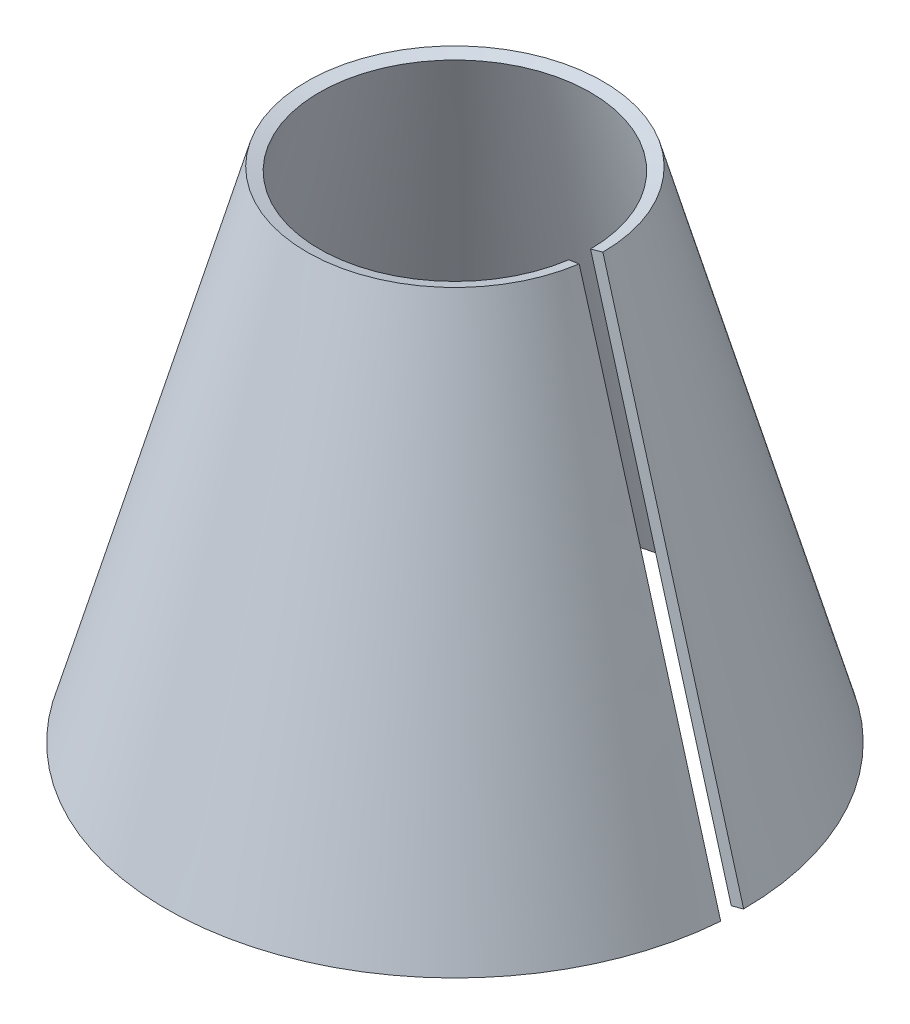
ISO-10303-21;
HEADER;
FILE_DESCRIPTION(('STEP AP214'),'2;1');
FILE_NAME('part.step','',(''),(''),'','','');
FILE_SCHEMA(('AUTOMOTIVE_DESIGN { 1 0 10303 214 1 1 1 1 }'));
ENDSEC;
DATA;
#1=APPLICATION_CONTEXT('core data for automotive mechanical design processes');
#2=APPLICATION_PROTOCOL_DEFINITION('international standard','automotive_design',2000,#1);
#3=PRODUCT_CONTEXT('',#1,'mechanical');
#4=PRODUCT('Part','Part','',(#3));
#5=PRODUCT_RELATED_PRODUCT_CATEGORY('part','',(#4));
#6=PRODUCT_DEFINITION_FORMATION('','',#4);
#7=PRODUCT_DEFINITION_CONTEXT('part definition',#1,'design');
#8=PRODUCT_DEFINITION('design','',#6,#7);
#9=PRODUCT_DEFINITION_SHAPE('','',#8);
#10=(LENGTH_UNIT() NAMED_UNIT(*) SI_UNIT(.MILLI.,.METRE.));
#11=(NAMED_UNIT(*) PLANE_ANGLE_UNIT() SI_UNIT($,.RADIAN.));
#12=(NAMED_UNIT(*) SI_UNIT($,.STERADIAN.) SOLID_ANGLE_UNIT());
#13=UNCERTAINTY_MEASURE_WITH_UNIT(LENGTH_MEASURE(1.E-05),#10,'distance_accuracy_value','');
#14=(GEOMETRIC_REPRESENTATION_CONTEXT(3) GLOBAL_UNCERTAINTY_ASSIGNED_CONTEXT((#13)) GLOBAL_UNIT_ASSIGNED_CONTEXT((#10,
#11,#12)) REPRESENTATION_CONTEXT('',''));
#15=CARTESIAN_POINT('',(0.,0.,0.));
#16=DIRECTION('',(0.,0.,1.));
#17=DIRECTION('',(1.,0.,0.));
#18=AXIS2_PLACEMENT_3D('',#15,#16,#17);
#19=CARTESIAN_POINT('',(0.,98.4631230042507,0.));
#20=DIRECTION('',(0.,1.,0.));
#21=DIRECTION('',(0.,0.,1.));
#22=AXIS2_PLACEMENT_3D('',#19,#20,#21);
#23=CONICAL_SURFACE('',#22,28.10571724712,1.29561044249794);
#24=CARTESIAN_POINT('',(26.582516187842,98.1180311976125,4.01154323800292));
#25=CARTESIAN_POINT('',(28.9995803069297,98.8082148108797,4.37630017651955));
#26=B_SPLINE_CURVE_WITH_KNOTS('',1,(#24,#25),.UNSPECIFIED.,.F.,.F.,(2,2),(0.,1.),.UNSPECIFIED.);
#27=CARTESIAN_POINT('',(26.5825161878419,98.1180311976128,4.01154323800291));
#28=VERTEX_POINT('',#27);
#29=CARTESIAN_POINT('',(28.9995803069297,98.8082148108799,4.37630017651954));
#30=VERTEX_POINT('',#29);
#31=EDGE_CURVE('E13',#28,#30,#26,.T.);
#32=ORIENTED_EDGE('',*,*,#31,.F.);
#33=CARTESIAN_POINT('',(0.,98.1180311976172,0.));
#34=DIRECTION('',(0.,-1.,0.));
#35=DIRECTION('',(0.,0.,-1.));
#36=AXIS2_PLACEMENT_3D('',#33,#34,#35);
#37=CIRCLE('',#36,26.8835013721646);
#38=CARTESIAN_POINT('',(26.8835013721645,98.1180311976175,0.));
#39=VERTEX_POINT('',#38);
#40=EDGE_CURVE('E97',#39,#28,#37,.F.);
#41=ORIENTED_EDGE('',*,*,#40,.F.);
#42=DIRECTION('',(0.962374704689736,0.271725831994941,0.));
#43=VECTOR('',#42,1.);
#44=CARTESIAN_POINT('',(28.1057172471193,98.4631230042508,0.));
#45=LINE('',#44,#43);
#46=CARTESIAN_POINT('',(29.3279331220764,98.8082148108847,0.));
#47=VERTEX_POINT('',#46);
#48=EDGE_CURVE('E56',#39,#47,#45,.T.);
#49=ORIENTED_EDGE('',*,*,#48,.T.);
#50=CARTESIAN_POINT('',(0.,98.8082148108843,0.));
#51=DIRECTION('',(0.,-1.,0.));
#52=DIRECTION('',(0.,0.,-1.));
#53=AXIS2_PLACEMENT_3D('',#50,#51,#52);
#54=CIRCLE('',#53,29.3279331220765);
#55=EDGE_CURVE('E96',#47,#30,#54,.F.);
#56=ORIENTED_EDGE('',*,*,#55,.T.);
#57=EDGE_LOOP('',(#32,#41,#49,#56));
#58=FACE_BOUND('',#57,.T.);
#59=ADVANCED_FACE('F42',(#58),#23,.F.);
#60=CARTESIAN_POINT('',(56.0041483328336,-0.345091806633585,0.));
#61=DIRECTION('',(0.,0.,-1.));
#62=DIRECTION('',(-0.27172583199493,0.962374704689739,0.));
#63=AXIS2_PLACEMENT_3D('',#60,#61,#62);
#64=PLANE('',#63);
#65=ORIENTED_EDGE('',*,*,#48,.F.);
#66=DIRECTION('',(0.271725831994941,-0.962374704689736,0.));
#67=VECTOR('',#66,1.);
#68=CARTESIAN_POINT('',(335.839104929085,-996.113811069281,0.));
#69=LINE('',#68,#67);
#70=CARTESIAN_POINT('',(54.7819324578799,-0.69018361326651,0.));
#71=VERTEX_POINT('',#70);
#72=EDGE_CURVE('E114',#71,#39,#69,.F.);
#73=ORIENTED_EDGE('',*,*,#72,.F.);
#74=DIRECTION('',(0.962374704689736,0.271725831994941,0.));
#75=VECTOR('',#74,1.);
#76=CARTESIAN_POINT('',(56.0041483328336,-0.345091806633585,0.));
#77=LINE('',#76,#75);
#78=CARTESIAN_POINT('',(57.2263642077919,6.52364447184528E-13,0.));
#79=VERTEX_POINT('',#78);
#80=EDGE_CURVE('E92',#71,#79,#77,.T.);
#81=ORIENTED_EDGE('',*,*,#80,.T.);
#82=DIRECTION('',(0.271725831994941,-0.962374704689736,0.));
#83=VECTOR('',#82,1.);
#84=CARTESIAN_POINT('',(338.283536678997,-995.423627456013,0.));
#85=LINE('',#84,#83);
#86=EDGE_CURVE('E104',#79,#47,#85,.F.);
#87=ORIENTED_EDGE('',*,*,#86,.T.);
#88=EDGE_LOOP('',(#65,#73,#81,#87));
#89=FACE_BOUND('',#88,.T.);
#90=ADVANCED_FACE('F108',(#89),#64,.F.);
#91=CARTESIAN_POINT('',(0.,-0.345091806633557,0.));
#92=DIRECTION('',(0.,1.,0.));
#93=DIRECTION('',(0.,0.,1.));
#94=AXIS2_PLACEMENT_3D('',#91,#92,#93);
#95=CONICAL_SURFACE('',#94,56.0041483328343,1.29561044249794);
#96=ORIENTED_EDGE('',*,*,#80,.F.);
#97=CARTESIAN_POINT('',(0.,-0.690183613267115,0.));
#98=DIRECTION('',(0.,-1.,0.));
#99=DIRECTION('',(0.,0.,-1.));
#100=AXIS2_PLACEMENT_3D('',#97,#98,#99);
#101=CIRCLE('',#100,54.7819324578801);
#102=CARTESIAN_POINT('',(54.621509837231,-0.690183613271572,4.18936593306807));
#103=VERTEX_POINT('',#102);
#104=EDGE_CURVE('E109',#71,#103,#101,.F.);
#105=ORIENTED_EDGE('',*,*,#104,.T.);
#106=CARTESIAN_POINT('',(57.0587833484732,-4.42256908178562E-12,4.37630017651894));
#107=CARTESIAN_POINT('',(54.621509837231,-0.690183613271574,4.18936593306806));
#108=B_SPLINE_CURVE_WITH_KNOTS('',1,(#106,#107),.UNSPECIFIED.,.F.,.F.,(2,2),(0.,1.),.UNSPECIFIED.);
#109=CARTESIAN_POINT('',(57.0587833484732,-4.44089209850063E-12,4.37630017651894));
#110=VERTEX_POINT('',#109);
#111=EDGE_CURVE('E64',#103,#110,#108,.F.);
#112=ORIENTED_EDGE('',*,*,#111,.T.);
#113=CARTESIAN_POINT('',(0.,0.,0.));
#114=DIRECTION('',(0.,-1.,0.));
#115=DIRECTION('',(0.,0.,-1.));
#116=AXIS2_PLACEMENT_3D('',#113,#114,#115);
#117=CIRCLE('',#116,57.226364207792);
#118=EDGE_CURVE('E233',#79,#110,#117,.F.);
#119=ORIENTED_EDGE('',*,*,#118,.F.);
#120=EDGE_LOOP('',(#96,#105,#112,#119));
#121=FACE_BOUND('',#120,.T.);
#122=ADVANCED_FACE('F136',(#121),#95,.T.);
#123=CARTESIAN_POINT('',(28.9995803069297,98.8082148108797,4.37630017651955));
#124=CARTESIAN_POINT('',(29.7280403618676,96.2633312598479,4.36451771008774));
#125=CARTESIAN_POINT('',(30.4625193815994,93.6937188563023,4.35465808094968));
#126=CARTESIAN_POINT('',(31.573151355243,89.8022062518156,4.34571432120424));
#127=CARTESIAN_POINT('',(31.9448479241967,88.4988530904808,4.34370864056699));
#128=CARTESIAN_POINT('',(32.5046092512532,86.5345499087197,4.34254518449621));
#129=CARTESIAN_POINT('',(32.6912564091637,85.8793262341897,4.34246057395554));
#130=CARTESIAN_POINT('',(33.0771418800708,84.5239732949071,4.34337211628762));
#131=CARTESIAN_POINT('',(33.2749127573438,83.8290232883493,4.34430723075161));
#132=CARTESIAN_POINT('',(33.6801161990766,82.4045762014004,4.3471007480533));
#133=CARTESIAN_POINT('',(33.8875487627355,81.6750791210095,4.34895915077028));
#134=CARTESIAN_POINT('',(34.1528811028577,80.7416158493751,4.35183886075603));
#135=CARTESIAN_POINT('',(34.2062496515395,80.5538435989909,4.35244264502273));
#136=CARTESIAN_POINT('',(34.2867556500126,80.2705658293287,4.35338972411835));
#137=CARTESIAN_POINT('',(34.3138207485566,80.1753277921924,4.35371314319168));
#138=CARTESIAN_POINT('',(34.3712877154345,79.9731147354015,4.35438190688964));
#139=CARTESIAN_POINT('',(34.4013007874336,79.8675063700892,4.35472581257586));
#140=CARTESIAN_POINT('',(34.557764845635,79.3169553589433,4.35648174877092));
#141=CARTESIAN_POINT('',(34.7034117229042,78.804485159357,4.35800679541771));
#142=CARTESIAN_POINT('',(35.0356794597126,77.6354859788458,4.36094979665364));
#143=CARTESIAN_POINT('',(35.2223003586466,76.9789569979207,4.36236775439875));
#144=CARTESIAN_POINT('',(35.5329827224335,75.886119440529,4.36408074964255));
#145=CARTESIAN_POINT('',(35.6416687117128,75.5038329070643,4.36458199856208));
#146=CARTESIAN_POINT('',(35.8123883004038,74.9033920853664,4.36518070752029));
#147=CARTESIAN_POINT('',(35.8705765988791,74.6987433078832,4.36535470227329));
#148=CARTESIAN_POINT('',(35.9895172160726,74.2804420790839,4.36564288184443));
#149=CARTESIAN_POINT('',(36.0506809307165,74.0653422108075,4.36575907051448));
#150=CARTESIAN_POINT('',(36.5995245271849,72.1352642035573,4.36642727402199));
#151=CARTESIAN_POINT('',(37.0865242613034,70.4232733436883,4.36444179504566));
#152=CARTESIAN_POINT('',(37.6941743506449,68.2878273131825,4.35873102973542));
#153=CARTESIAN_POINT('',(37.8144618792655,67.8651916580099,4.3573085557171));
#154=CARTESIAN_POINT('',(38.0630849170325,66.9913370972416,4.35495952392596));
#155=CARTESIAN_POINT('',(38.1910213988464,66.5415393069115,4.35399040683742));
#156=CARTESIAN_POINT('',(38.5857093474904,65.1535344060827,4.35165436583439));
#157=CARTESIAN_POINT('',(38.8633393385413,64.1767157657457,4.35085896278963));
#158=CARTESIAN_POINT('',(39.3015554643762,62.6342647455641,4.35062545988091));
#159=CARTESIAN_POINT('',(39.4508500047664,62.1086814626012,4.35068642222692));
#160=CARTESIAN_POINT('',(39.7585019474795,61.0253881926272,4.35119060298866));
#161=CARTESIAN_POINT('',(39.918011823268,60.4635978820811,4.35169305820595));
#162=CARTESIAN_POINT('',(40.413599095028,58.7177959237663,4.35386773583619));
#163=CARTESIAN_POINT('',(40.7667341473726,57.4733532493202,4.35620820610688));
#164=CARTESIAN_POINT('',(41.189615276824,55.9827087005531,4.35957927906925));
#165=CARTESIAN_POINT('',(41.2369576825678,55.8158225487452,4.35996407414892));
#166=CARTESIAN_POINT('',(41.3323537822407,55.479532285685,4.36075317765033));
#167=CARTESIAN_POINT('',(41.3822871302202,55.3035054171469,4.3611641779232));
#168=CARTESIAN_POINT('',(41.5452383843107,54.7290751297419,4.36244444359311));
#169=CARTESIAN_POINT('',(41.6687409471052,54.2937170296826,4.36335330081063));
#170=CARTESIAN_POINT('',(42.0838661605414,52.8304290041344,4.36601825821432));
#171=CARTESIAN_POINT('',(42.4201057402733,51.6452853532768,4.36773093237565));
#172=CARTESIAN_POINT('',(42.8653476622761,50.0761781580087,4.36865733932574));
#173=CARTESIAN_POINT('',(42.9157491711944,49.898557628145,4.36874600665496));
#174=CARTESIAN_POINT('',(43.0184127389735,49.5367659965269,4.36889094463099));
#175=CARTESIAN_POINT('',(43.0709545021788,49.3516090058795,4.36894799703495));
#176=CARTESIAN_POINT('',(43.2280656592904,48.7979624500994,4.36905455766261));
#177=CARTESIAN_POINT('',(43.332789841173,48.4289392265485,4.36904295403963));
#178=CARTESIAN_POINT('',(43.6469123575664,47.3220929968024,4.3687600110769));
#179=CARTESIAN_POINT('',(43.8562606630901,46.5844934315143,4.36824053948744));
#180=CARTESIAN_POINT('',(44.2748224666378,45.1098901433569,4.36653884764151));
#181=CARTESIAN_POINT('',(44.4840359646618,44.3728864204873,4.36535662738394));
#182=CARTESIAN_POINT('',(44.7977540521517,43.2678277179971,4.36308544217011));
#183=CARTESIAN_POINT('',(44.9021835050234,42.899997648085,4.36223549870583));
#184=CARTESIAN_POINT('',(45.1168956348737,42.1435632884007,4.36086312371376));
#185=CARTESIAN_POINT('',(45.2264469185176,41.7575586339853,4.36027816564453));
#186=CARTESIAN_POINT('',(45.5616875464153,40.5761822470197,4.35881035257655));
#187=CARTESIAN_POINT('',(45.7939636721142,39.7574480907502,4.35821461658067));
#188=CARTESIAN_POINT('',(46.1555558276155,38.4826220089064,4.35782767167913));
#189=CARTESIAN_POINT('',(46.2782828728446,38.0498925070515,4.35778311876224));
#190=CARTESIAN_POINT('',(46.5281303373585,37.1688585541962,4.35785143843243));
#191=CARTESIAN_POINT('',(46.6551074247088,36.7210615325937,4.35795843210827));
#192=CARTESIAN_POINT('',(47.0466368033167,35.3401204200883,4.35867150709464));
#193=CARTESIAN_POINT('',(47.320510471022,34.3739475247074,4.35961164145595));
#194=CARTESIAN_POINT('',(47.7506089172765,32.8563699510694,4.36160389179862));
#195=CARTESIAN_POINT('',(47.8971897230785,32.3391243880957,4.36236493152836));
#196=CARTESIAN_POINT('',(48.1218837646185,31.5461764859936,4.3636370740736));
#197=CARTESIAN_POINT('',(48.1975855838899,31.2790139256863,4.36408288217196));
#198=CARTESIAN_POINT('',(48.3123441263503,30.8740001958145,4.36478234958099));
#199=CARTESIAN_POINT('',(48.3508727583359,30.7380200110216,4.36502096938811));
#200=CARTESIAN_POINT('',(48.4327424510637,30.4490790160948,4.36550710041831));
#201=CARTESIAN_POINT('',(48.4755340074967,30.2980565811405,4.3657542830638));
#202=CARTESIAN_POINT('',(48.8773694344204,28.8798872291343,4.36799396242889));
#203=CARTESIAN_POINT('',(49.353390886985,27.1999682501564,4.37016270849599));
#204=CARTESIAN_POINT('',(50.022688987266,24.8383198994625,4.37084587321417));
#205=CARTESIAN_POINT('',(50.0993693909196,24.5677536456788,4.37089679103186));
#206=CARTESIAN_POINT('',(50.2517742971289,24.0300051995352,4.37093127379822));
#207=CARTESIAN_POINT('',(50.3279733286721,23.7611483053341,4.37091648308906));
#208=CARTESIAN_POINT('',(50.5565601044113,22.9546296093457,4.37077595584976));
#209=CARTESIAN_POINT('',(50.7089375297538,22.4170197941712,4.37055406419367));
#210=CARTESIAN_POINT('',(51.1660280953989,20.8043982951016,4.36950329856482));
#211=CARTESIAN_POINT('',(51.4706995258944,19.7295945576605,4.36828933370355));
#212=CARTESIAN_POINT('',(51.8514678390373,18.3864364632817,4.36612849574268));
#213=CARTESIAN_POINT('',(51.9288812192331,18.1133508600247,4.36570806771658));
#214=CARTESIAN_POINT('',(52.0906337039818,17.5426777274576,4.36503193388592));
#215=CARTESIAN_POINT('',(52.1743059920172,17.2474503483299,4.36475325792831));
#216=CARTESIAN_POINT('',(52.4337117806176,16.3320957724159,4.36407883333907));
#217=CARTESIAN_POINT('',(52.617834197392,15.6822961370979,4.36384496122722));
#218=CARTESIAN_POINT('',(53.0084538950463,14.3035703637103,4.36371377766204));
#219=CARTESIAN_POINT('',(53.2149511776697,13.574644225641,4.36381646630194));
#220=CARTESIAN_POINT('',(53.5414817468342,12.4219101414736,4.36414516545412));
#221=CARTESIAN_POINT('',(53.6532983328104,12.0271550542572,4.36428211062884));
#222=CARTESIAN_POINT('',(53.8779542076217,11.2339978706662,4.3646288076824));
#223=CARTESIAN_POINT('',(53.9913530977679,10.8336211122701,4.36483624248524));
#224=CARTESIAN_POINT('',(55.0215824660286,7.19604678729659,4.36699609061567));
#225=CARTESIAN_POINT('',(56.0058889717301,3.71956477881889,4.37099839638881));
#226=CARTESIAN_POINT('',(57.0587833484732,-4.42256908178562E-12,4.37630017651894));
#227=CARTESIAN_POINT('',(26.582516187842,98.1180311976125,4.01154323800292));
#228=CARTESIAN_POINT('',(27.3094794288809,95.5731475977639,4.00967951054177));
#229=CARTESIAN_POINT('',(28.0426448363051,93.0035352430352,4.00893546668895));
#230=CARTESIAN_POINT('',(29.1515400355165,89.1120226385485,4.01245348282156));
#231=CARTESIAN_POINT('',(29.5226966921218,87.8086694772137,4.01439981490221));
#232=CARTESIAN_POINT('',(30.081702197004,85.8443662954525,4.01886082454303));
#233=CARTESIAN_POINT('',(30.2681066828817,85.1891426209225,4.02059829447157));
#234=CARTESIAN_POINT('',(30.6535133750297,83.8337896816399,4.02513510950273));
#235=CARTESIAN_POINT('',(30.8510495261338,83.1388396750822,4.02786321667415));
#236=CARTESIAN_POINT('',(31.2557925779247,81.7143925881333,4.03420338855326));
#237=CARTESIAN_POINT('',(31.4629994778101,80.9848955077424,4.03781545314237));
#238=CARTESIAN_POINT('',(31.7280552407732,80.0514322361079,4.04286263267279));
#239=CARTESIAN_POINT('',(31.7813687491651,79.8636599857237,4.04389868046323));
#240=CARTESIAN_POINT('',(31.8617925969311,79.5803822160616,4.04549230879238));
#241=CARTESIAN_POINT('',(31.8888302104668,79.4851441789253,4.0460322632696));
#242=CARTESIAN_POINT('',(31.9462388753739,79.2829311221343,4.04716088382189));
#243=CARTESIAN_POINT('',(31.9762215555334,79.1773227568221,4.04774476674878));
#244=CARTESIAN_POINT('',(32.1325274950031,78.6267717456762,4.050750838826));
#245=CARTESIAN_POINT('',(32.278028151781,78.1143015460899,4.0534367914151));
#246=CARTESIAN_POINT('',(32.6099653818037,76.9453023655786,4.05902337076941));
#247=CARTESIAN_POINT('',(32.7964019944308,76.2887733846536,4.06192400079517));
#248=CARTESIAN_POINT('',(33.1067807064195,75.1959358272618,4.0661024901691));
#249=CARTESIAN_POINT('',(33.2153609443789,74.8136492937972,4.06746581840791));
#250=CARTESIAN_POINT('',(33.3859152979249,74.2132084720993,4.0694180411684));
#251=CARTESIAN_POINT('',(33.4440474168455,74.0085596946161,4.07005327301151));
#252=CARTESIAN_POINT('',(33.5628735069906,73.5902584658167,4.07128406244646));
#253=CARTESIAN_POINT('',(33.6239784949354,73.3751585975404,4.07188476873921));
#254=CARTESIAN_POINT('',(34.1722961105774,71.4450805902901,4.07690358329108));
#255=CARTESIAN_POINT('',(34.6588364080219,69.7330897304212,4.0787958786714));
#256=CARTESIAN_POINT('',(35.2659225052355,67.5976436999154,4.07794550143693));
#257=CARTESIAN_POINT('',(35.386097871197,67.1750080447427,4.07749470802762));
#258=CARTESIAN_POINT('',(35.6344967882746,66.3011534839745,4.07709760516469));
#259=CARTESIAN_POINT('',(35.7623213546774,65.8513556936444,4.07710838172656));
#260=CARTESIAN_POINT('',(36.1566740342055,64.4633507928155,4.07772381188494));
#261=CARTESIAN_POINT('',(36.4340811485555,63.4865321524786,4.07891177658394));
#262=CARTESIAN_POINT('',(36.8719640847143,61.944081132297,4.0816769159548));
#263=CARTESIAN_POINT('',(37.0211479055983,61.418497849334,4.08273993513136));
#264=CARTESIAN_POINT('',(37.3285781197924,60.33520457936,4.08526241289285));
#265=CARTESIAN_POINT('',(37.4879765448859,59.773414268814,4.08678514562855));
#266=CARTESIAN_POINT('',(37.9832278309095,58.0276123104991,4.09205405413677));
#267=CARTESIAN_POINT('',(38.3361367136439,56.7831696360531,4.0965018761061));
#268=CARTESIAN_POINT('',(38.7587613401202,55.292525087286,4.10229385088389));
#269=CARTESIAN_POINT('',(38.8060752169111,55.1256389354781,4.10294833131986));
#270=CARTESIAN_POINT('',(38.9014142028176,54.7893486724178,4.10427819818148));
#271=CARTESIAN_POINT('',(38.9513177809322,54.6133218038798,4.10497148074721));
#272=CARTESIAN_POINT('',(39.1141720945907,54.0388915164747,4.10717271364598));
#273=CARTESIAN_POINT('',(39.2376015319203,53.6035334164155,4.10877848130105));
#274=CARTESIAN_POINT('',(39.6524825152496,52.1402453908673,4.11378303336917));
#275=CARTESIAN_POINT('',(39.9885260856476,50.9551017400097,4.11738725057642));
#276=CARTESIAN_POINT('',(40.4335127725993,49.3859945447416,4.12081519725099));
#277=CARTESIAN_POINT('',(40.4838854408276,49.2083740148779,4.1211870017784));
#278=CARTESIAN_POINT('',(40.5864903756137,48.8465823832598,4.12190859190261));
#279=CARTESIAN_POINT('',(40.6390021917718,48.6614253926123,4.12226069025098));
#280=CARTESIAN_POINT('',(40.7960239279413,48.1077788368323,4.12324986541));
#281=CARTESIAN_POINT('',(40.9006886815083,47.7387556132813,4.12382696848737));
#282=CARTESIAN_POINT('',(41.2146334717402,46.6319093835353,4.12531103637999));
#283=CARTESIAN_POINT('',(41.4238640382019,45.8943098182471,4.12597075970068));
#284=CARTESIAN_POINT('',(41.84219186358,44.4197065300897,4.12662983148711));
#285=CARTESIAN_POINT('',(42.0512891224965,43.6827028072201,4.12662917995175));
#286=CARTESIAN_POINT('',(42.3648339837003,42.5776441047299,4.12613212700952));
#287=CARTESIAN_POINT('',(42.4692058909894,42.2098140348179,4.1258737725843));
#288=CARTESIAN_POINT('',(42.6838029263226,41.4533796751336,4.12568912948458));
#289=CARTESIAN_POINT('',(42.7932967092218,41.0673750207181,4.12569982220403));
#290=CARTESIAN_POINT('',(43.1283649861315,39.8859986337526,4.12602431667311));
#291=CARTESIAN_POINT('',(43.36052641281,39.0672644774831,4.12663059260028));
#292=CARTESIAN_POINT('',(43.7219468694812,37.7924383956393,4.12805737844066));
#293=CARTESIAN_POINT('',(43.8446167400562,37.3597088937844,4.12861918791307));
#294=CARTESIAN_POINT('',(44.0943499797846,36.478674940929,4.12990380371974));
#295=CARTESIAN_POINT('',(44.2212700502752,36.0308779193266,4.13062036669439));
#296=CARTESIAN_POINT('',(44.6126276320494,34.6499368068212,4.13317769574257));
#297=CARTESIAN_POINT('',(44.8863860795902,33.6837639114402,4.1353648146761));
#298=CARTESIAN_POINT('',(45.3163107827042,32.1661863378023,4.13925377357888));
#299=CARTESIAN_POINT('',(45.4628335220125,31.6489407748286,4.14065142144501));
#300=CARTESIAN_POINT('',(45.6874402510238,30.8559928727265,4.14288503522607));
#301=CARTESIAN_POINT('',(45.7631129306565,30.5888303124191,4.14365242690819));
#302=CARTESIAN_POINT('',(45.8778277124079,30.1838165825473,4.14483590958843));
#303=CARTESIAN_POINT('',(45.9163417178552,30.0478363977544,4.14523647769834));
#304=CARTESIAN_POINT('',(45.9981803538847,29.7588954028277,4.14606689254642));
#305=CARTESIAN_POINT('',(46.0409557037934,29.6078729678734,4.14649393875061));
#306=CARTESIAN_POINT('',(46.4426392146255,28.1897036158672,4.15042188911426));
#307=CARTESIAN_POINT('',(46.9184824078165,26.5097846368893,4.15458552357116));
#308=CARTESIAN_POINT('',(47.5875354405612,24.1481362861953,4.15806927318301));
#309=CARTESIAN_POINT('',(47.664187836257,23.8775700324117,4.15844096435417));
#310=CARTESIAN_POINT('',(47.8165371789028,23.339821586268,4.15911328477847));
#311=CARTESIAN_POINT('',(47.8927084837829,23.070964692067,4.15941750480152));
#312=CARTESIAN_POINT('',(48.1212122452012,22.2644459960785,4.16023428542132));
#313=CARTESIAN_POINT('',(48.2735345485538,21.726836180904,4.1606509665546));
#314=CARTESIAN_POINT('',(48.7304604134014,20.1142146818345,4.16151702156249));
#315=CARTESIAN_POINT('',(49.0350229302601,19.0394109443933,4.16158240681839));
#316=CARTESIAN_POINT('',(49.4156562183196,17.6962528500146,4.16102259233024));
#317=CARTESIAN_POINT('',(49.4930424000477,17.4231672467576,4.16092540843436));
#318=CARTESIAN_POINT('',(49.6547392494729,16.8524941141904,4.1609121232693));
#319=CARTESIAN_POINT('',(49.7383832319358,16.5572667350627,4.16097149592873));
#320=CARTESIAN_POINT('',(49.9977026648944,15.6419121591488,4.16133109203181));
#321=CARTESIAN_POINT('',(50.1817655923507,14.9921125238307,4.16181306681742));
#322=CARTESIAN_POINT('',(50.572262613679,13.6133867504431,4.16316658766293));
#323=CARTESIAN_POINT('',(50.7786967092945,12.8844606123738,4.16403813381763));
#324=CARTESIAN_POINT('',(51.1051298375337,11.7317265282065,4.16555988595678));
#325=CARTESIAN_POINT('',(51.2169134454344,11.3369714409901,4.16610182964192));
#326=CARTESIAN_POINT('',(51.4415039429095,10.543814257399,4.1672539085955));
#327=CARTESIAN_POINT('',(51.5548702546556,10.143437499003,4.16786391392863));
#328=CARTESIAN_POINT('',(52.5848074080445,6.50586317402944,4.17364581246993));
#329=CARTESIAN_POINT('',(53.5688612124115,3.02938116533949,4.18086000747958));
#330=CARTESIAN_POINT('',(54.621509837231,-0.690183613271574,4.18936593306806));
#331=B_SPLINE_SURFACE_WITH_KNOTS('',1,3,((#123,#124,#125,#126,#127,#128,#129,#130,#131,#132,
#133,#134,#135,#136,#137,#138,#139,#140,#141,#142,#143,#144,#145,#146,#147,#148,#149,#150,#151,
#152,#153,#154,#155,#156,#157,#158,#159,#160,#161,#162,#163,#164,#165,#166,#167,#168,#169,#170,
#171,#172,#173,#174,#175,#176,#177,#178,#179,#180,#181,#182,#183,#184,#185,#186,#187,#188,#189,
#190,#191,#192,#193,#194,#195,#196,#197,#198,#199,#200,#201,#202,#203,#204,#205,#206,#207,#208,
#209,#210,#211,#212,#213,#214,#215,#216,#217,#218,#219,#220,#221,#222,#223,#224,#225,#226),
(#227,#228,#229,#230,#231,#232,#233,#234,#235,#236,#237,#238,#239,#240,#241,#242,#243,#244,#245,
#246,#247,#248,#249,#250,#251,#252,#253,#254,#255,#256,#257,#258,#259,#260,#261,#262,#263,#264,
#265,#266,#267,#268,#269,#270,#271,#272,#273,#274,#275,#276,#277,#278,#279,#280,#281,#282,#283,
#284,#285,#286,#287,#288,#289,#290,#291,#292,#293,#294,#295,#296,#297,#298,#299,#300,#301,#302,
#303,#304,#305,#306,#307,#308,#309,#310,#311,#312,#313,#314,#315,#316,#317,#318,#319,#320,#321,
#322,#323,#324,#325,#326,#327,#328,#329,#330)),.UNSPECIFIED.,.F.,.F.,.F.,(2,2),(4,2,2,2,2,2,2,2,
2,2,2,2,2,2,2,2,2,2,2,2,2,2,2,2,2,2,2,2,2,2,2,2,2,2,2,2,2,2,2,2,2,2,2,2,2,2,2,2,2,2,2,4),(0.,
1.),(0.,0.25,0.375,0.4375,0.5,0.5625,0.578125,0.5859375,0.59375,0.625,0.65625,0.671875,
0.6796875,0.6875,0.75,0.765625,0.78125,0.8125,0.828125,0.84375,0.875,0.87890625,0.8828125,
0.890625,0.90625,0.908203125,0.91015625,0.9140625,0.921875,0.9296875,0.93359375,0.9375,
0.9453125,0.94921875,0.953125,0.9609375,0.96484375,0.966796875,0.9677734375,0.96875,0.9765625,
0.9775390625,0.978515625,0.98046875,0.984375,0.9853515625,0.986328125,0.98828125,0.990234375,
0.9912109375,0.9921875,1.),.UNSPECIFIED.);
#332=CARTESIAN_POINT('',(54.621509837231,-0.690183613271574,4.18936593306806));
#333=CARTESIAN_POINT('',(53.5688612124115,3.02938116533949,4.18086000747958));
#334=CARTESIAN_POINT('',(52.5848074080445,6.50586317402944,4.17364581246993));
#335=CARTESIAN_POINT('',(51.5548702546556,10.143437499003,4.16786391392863));
#336=CARTESIAN_POINT('',(51.4415039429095,10.543814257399,4.1672539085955));
#337=CARTESIAN_POINT('',(51.2169134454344,11.3369714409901,4.16610182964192));
#338=CARTESIAN_POINT('',(51.1051298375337,11.7317265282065,4.16555988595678));
#339=CARTESIAN_POINT('',(50.7786967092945,12.8844606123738,4.16403813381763));
#340=CARTESIAN_POINT('',(50.572262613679,13.6133867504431,4.16316658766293));
#341=CARTESIAN_POINT('',(50.1817655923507,14.9921125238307,4.16181306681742));
#342=CARTESIAN_POINT('',(49.9977026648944,15.6419121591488,4.16133109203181));
#343=CARTESIAN_POINT('',(49.7383832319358,16.5572667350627,4.16097149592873));
#344=CARTESIAN_POINT('',(49.6547392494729,16.8524941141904,4.1609121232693));
#345=CARTESIAN_POINT('',(49.4930424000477,17.4231672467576,4.16092540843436));
#346=CARTESIAN_POINT('',(49.4156562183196,17.6962528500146,4.16102259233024));
#347=CARTESIAN_POINT('',(49.0350229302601,19.0394109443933,4.16158240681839));
#348=CARTESIAN_POINT('',(48.7304604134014,20.1142146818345,4.16151702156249));
#349=CARTESIAN_POINT('',(48.2735345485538,21.726836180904,4.1606509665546));
#350=CARTESIAN_POINT('',(48.1212122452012,22.2644459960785,4.16023428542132));
#351=CARTESIAN_POINT('',(47.8927084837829,23.070964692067,4.15941750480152));
#352=CARTESIAN_POINT('',(47.8165371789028,23.339821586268,4.15911328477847));
#353=CARTESIAN_POINT('',(47.664187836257,23.8775700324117,4.15844096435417));
#354=CARTESIAN_POINT('',(47.5875354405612,24.1481362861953,4.15806927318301));
#355=CARTESIAN_POINT('',(46.9184824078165,26.5097846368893,4.15458552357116));
#356=CARTESIAN_POINT('',(46.4426392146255,28.1897036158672,4.15042188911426));
#357=CARTESIAN_POINT('',(46.0409557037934,29.6078729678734,4.14649393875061));
#358=CARTESIAN_POINT('',(45.9981803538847,29.7588954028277,4.14606689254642));
#359=CARTESIAN_POINT('',(45.9163417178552,30.0478363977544,4.14523647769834));
#360=CARTESIAN_POINT('',(45.8778277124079,30.1838165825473,4.14483590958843));
#361=CARTESIAN_POINT('',(45.7631129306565,30.5888303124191,4.14365242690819));
#362=CARTESIAN_POINT('',(45.6874402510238,30.8559928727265,4.14288503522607));
#363=CARTESIAN_POINT('',(45.4628335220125,31.6489407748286,4.14065142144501));
#364=CARTESIAN_POINT('',(45.3163107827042,32.1661863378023,4.13925377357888));
#365=CARTESIAN_POINT('',(44.8863860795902,33.6837639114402,4.1353648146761));
#366=CARTESIAN_POINT('',(44.6126276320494,34.6499368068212,4.13317769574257));
#367=CARTESIAN_POINT('',(44.2212700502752,36.0308779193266,4.13062036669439));
#368=CARTESIAN_POINT('',(44.0943499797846,36.478674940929,4.12990380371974));
#369=CARTESIAN_POINT('',(43.8446167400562,37.3597088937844,4.12861918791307));
#370=CARTESIAN_POINT('',(43.7219468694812,37.7924383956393,4.12805737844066));
#371=CARTESIAN_POINT('',(43.36052641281,39.0672644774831,4.12663059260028));
#372=CARTESIAN_POINT('',(43.1283649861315,39.8859986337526,4.12602431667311));
#373=CARTESIAN_POINT('',(42.7932967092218,41.0673750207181,4.12569982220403));
#374=CARTESIAN_POINT('',(42.6838029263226,41.4533796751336,4.12568912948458));
#375=CARTESIAN_POINT('',(42.4692058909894,42.2098140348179,4.1258737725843));
#376=CARTESIAN_POINT('',(42.3648339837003,42.5776441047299,4.12613212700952));
#377=CARTESIAN_POINT('',(42.0512891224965,43.6827028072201,4.12662917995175));
#378=CARTESIAN_POINT('',(41.84219186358,44.4197065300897,4.12662983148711));
#379=CARTESIAN_POINT('',(41.4238640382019,45.8943098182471,4.12597075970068));
#380=CARTESIAN_POINT('',(41.2146334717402,46.6319093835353,4.12531103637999));
#381=CARTESIAN_POINT('',(40.9006886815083,47.7387556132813,4.12382696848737));
#382=CARTESIAN_POINT('',(40.7960239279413,48.1077788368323,4.12324986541));
#383=CARTESIAN_POINT('',(40.6390021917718,48.6614253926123,4.12226069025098));
#384=CARTESIAN_POINT('',(40.5864903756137,48.8465823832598,4.12190859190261));
#385=CARTESIAN_POINT('',(40.4838854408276,49.2083740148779,4.1211870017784));
#386=CARTESIAN_POINT('',(40.4335127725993,49.3859945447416,4.12081519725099));
#387=CARTESIAN_POINT('',(39.9885260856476,50.9551017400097,4.11738725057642));
#388=CARTESIAN_POINT('',(39.6524825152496,52.1402453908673,4.11378303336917));
#389=CARTESIAN_POINT('',(39.2376015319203,53.6035334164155,4.10877848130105));
#390=CARTESIAN_POINT('',(39.1141720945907,54.0388915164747,4.10717271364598));
#391=CARTESIAN_POINT('',(38.9513177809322,54.6133218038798,4.10497148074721));
#392=CARTESIAN_POINT('',(38.9014142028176,54.7893486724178,4.10427819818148));
#393=CARTESIAN_POINT('',(38.8060752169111,55.1256389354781,4.10294833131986));
#394=CARTESIAN_POINT('',(38.7587613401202,55.292525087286,4.10229385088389));
#395=CARTESIAN_POINT('',(38.3361367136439,56.7831696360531,4.0965018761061));
#396=CARTESIAN_POINT('',(37.9832278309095,58.0276123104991,4.09205405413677));
#397=CARTESIAN_POINT('',(37.4879765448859,59.773414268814,4.08678514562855));
#398=CARTESIAN_POINT('',(37.3285781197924,60.33520457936,4.08526241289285));
#399=CARTESIAN_POINT('',(37.0211479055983,61.418497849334,4.08273993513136));
#400=CARTESIAN_POINT('',(36.8719640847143,61.944081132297,4.0816769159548));
#401=CARTESIAN_POINT('',(36.4340811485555,63.4865321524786,4.07891177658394));
#402=CARTESIAN_POINT('',(36.1566740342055,64.4633507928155,4.07772381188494));
#403=CARTESIAN_POINT('',(35.7623213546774,65.8513556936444,4.07710838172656));
#404=CARTESIAN_POINT('',(35.6344967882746,66.3011534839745,4.07709760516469));
#405=CARTESIAN_POINT('',(35.386097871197,67.1750080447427,4.07749470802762));
#406=CARTESIAN_POINT('',(35.2659225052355,67.5976436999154,4.07794550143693));
#407=CARTESIAN_POINT('',(34.6588364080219,69.7330897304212,4.0787958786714));
#408=CARTESIAN_POINT('',(34.1722961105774,71.4450805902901,4.07690358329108));
#409=CARTESIAN_POINT('',(33.6239784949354,73.3751585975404,4.07188476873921));
#410=CARTESIAN_POINT('',(33.5628735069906,73.5902584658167,4.07128406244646));
#411=CARTESIAN_POINT('',(33.4440474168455,74.0085596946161,4.07005327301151));
#412=CARTESIAN_POINT('',(33.3859152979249,74.2132084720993,4.0694180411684));
#413=CARTESIAN_POINT('',(33.2153609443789,74.8136492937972,4.06746581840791));
#414=CARTESIAN_POINT('',(33.1067807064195,75.1959358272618,4.0661024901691));
#415=CARTESIAN_POINT('',(32.7964019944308,76.2887733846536,4.06192400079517));
#416=CARTESIAN_POINT('',(32.6099653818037,76.9453023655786,4.05902337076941));
#417=CARTESIAN_POINT('',(32.278028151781,78.1143015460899,4.0534367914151));
#418=CARTESIAN_POINT('',(32.1325274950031,78.6267717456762,4.050750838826));
#419=CARTESIAN_POINT('',(31.9762215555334,79.1773227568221,4.04774476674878));
#420=CARTESIAN_POINT('',(31.9462388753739,79.2829311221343,4.04716088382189));
#421=CARTESIAN_POINT('',(31.8888302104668,79.4851441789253,4.0460322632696));
#422=CARTESIAN_POINT('',(31.8617925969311,79.5803822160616,4.04549230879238));
#423=CARTESIAN_POINT('',(31.7813687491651,79.8636599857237,4.04389868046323));
#424=CARTESIAN_POINT('',(31.7280552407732,80.0514322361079,4.04286263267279));
#425=CARTESIAN_POINT('',(31.4629994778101,80.9848955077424,4.03781545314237));
#426=CARTESIAN_POINT('',(31.2557925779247,81.7143925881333,4.03420338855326));
#427=CARTESIAN_POINT('',(30.8510495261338,83.1388396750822,4.02786321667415));
#428=CARTESIAN_POINT('',(30.6535133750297,83.8337896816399,4.02513510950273));
#429=CARTESIAN_POINT('',(30.2681066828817,85.1891426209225,4.02059829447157));
#430=CARTESIAN_POINT('',(30.081702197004,85.8443662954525,4.01886082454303));
#431=CARTESIAN_POINT('',(29.5226966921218,87.8086694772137,4.01439981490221));
#432=CARTESIAN_POINT('',(29.1515400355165,89.1120226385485,4.01245348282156));
#433=CARTESIAN_POINT('',(28.0426448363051,93.0035352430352,4.00893546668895));
#434=CARTESIAN_POINT('',(27.3094794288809,95.5731475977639,4.00967951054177));
#435=CARTESIAN_POINT('',(26.582516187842,98.1180311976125,4.01154323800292));
#436=B_SPLINE_CURVE_WITH_KNOTS('',3,(#332,#333,#334,#335,#336,#337,#338,#339,#340,#341,#342,
#343,#344,#345,#346,#347,#348,#349,#350,#351,#352,#353,#354,#355,#356,#357,#358,#359,#360,#361,
#362,#363,#364,#365,#366,#367,#368,#369,#370,#371,#372,#373,#374,#375,#376,#377,#378,#379,#380,
#381,#382,#383,#384,#385,#386,#387,#388,#389,#390,#391,#392,#393,#394,#395,#396,#397,#398,#399,
#400,#401,#402,#403,#404,#405,#406,#407,#408,#409,#410,#411,#412,#413,#414,#415,#416,#417,#418,
#419,#420,#421,#422,#423,#424,#425,#426,#427,#428,#429,#430,#431,#432,#433,#434,#435),
.UNSPECIFIED.,.F.,.F.,(4,2,2,2,2,2,2,2,2,2,2,2,2,2,2,2,2,2,2,2,2,2,2,2,2,2,2,2,2,2,2,2,2,2,2,2,
2,2,2,2,2,2,2,2,2,2,2,2,2,2,2,4),(0.,0.0078125,0.0087890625,0.009765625,0.01171875,0.013671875,
0.0146484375,0.015625,0.01953125,0.021484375,0.0224609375,0.0234375,0.03125,0.0322265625,
0.033203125,0.03515625,0.0390625,0.046875,0.05078125,0.0546875,0.0625,0.06640625,0.0703125,
0.078125,0.0859375,0.08984375,0.091796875,0.09375,0.109375,0.1171875,0.12109375,0.125,0.15625,
0.171875,0.1875,0.21875,0.234375,0.25,0.3125,0.3203125,0.328125,0.34375,0.375,0.40625,0.4140625,
0.421875,0.4375,0.5,0.5625,0.625,0.75,1.),.UNSPECIFIED.);
#437=EDGE_CURVE('E111',#28,#103,#436,.F.);
#438=CARTESIAN_POINT('',(28.9995803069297,98.8082148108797,4.37630017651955));
#439=CARTESIAN_POINT('',(29.7280403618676,96.2633312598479,4.36451771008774));
#440=CARTESIAN_POINT('',(30.4625193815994,93.6937188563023,4.35465808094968));
#441=CARTESIAN_POINT('',(31.573151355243,89.8022062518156,4.34571432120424));
#442=CARTESIAN_POINT('',(31.9448479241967,88.4988530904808,4.34370864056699));
#443=CARTESIAN_POINT('',(32.5046092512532,86.5345499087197,4.34254518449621));
#444=CARTESIAN_POINT('',(32.6912564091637,85.8793262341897,4.34246057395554));
#445=CARTESIAN_POINT('',(33.0771418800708,84.5239732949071,4.34337211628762));
#446=CARTESIAN_POINT('',(33.2749127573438,83.8290232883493,4.34430723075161));
#447=CARTESIAN_POINT('',(33.6801161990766,82.4045762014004,4.3471007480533));
#448=CARTESIAN_POINT('',(33.8875487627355,81.6750791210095,4.34895915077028));
#449=CARTESIAN_POINT('',(34.1528811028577,80.7416158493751,4.35183886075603));
#450=CARTESIAN_POINT('',(34.2062496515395,80.5538435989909,4.35244264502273));
#451=CARTESIAN_POINT('',(34.2867556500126,80.2705658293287,4.35338972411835));
#452=CARTESIAN_POINT('',(34.3138207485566,80.1753277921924,4.35371314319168));
#453=CARTESIAN_POINT('',(34.3712877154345,79.9731147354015,4.35438190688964));
#454=CARTESIAN_POINT('',(34.4013007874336,79.8675063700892,4.35472581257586));
#455=CARTESIAN_POINT('',(34.557764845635,79.3169553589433,4.35648174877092));
#456=CARTESIAN_POINT('',(34.7034117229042,78.804485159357,4.35800679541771));
#457=CARTESIAN_POINT('',(35.0356794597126,77.6354859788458,4.36094979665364));
#458=CARTESIAN_POINT('',(35.2223003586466,76.9789569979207,4.36236775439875));
#459=CARTESIAN_POINT('',(35.5329827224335,75.886119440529,4.36408074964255));
#460=CARTESIAN_POINT('',(35.6416687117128,75.5038329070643,4.36458199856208));
#461=CARTESIAN_POINT('',(35.8123883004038,74.9033920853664,4.36518070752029));
#462=CARTESIAN_POINT('',(35.8705765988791,74.6987433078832,4.36535470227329));
#463=CARTESIAN_POINT('',(35.9895172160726,74.2804420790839,4.36564288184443));
#464=CARTESIAN_POINT('',(36.0506809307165,74.0653422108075,4.36575907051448));
#465=CARTESIAN_POINT('',(36.5995245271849,72.1352642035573,4.36642727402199));
#466=CARTESIAN_POINT('',(37.0865242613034,70.4232733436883,4.36444179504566));
#467=CARTESIAN_POINT('',(37.6941743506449,68.2878273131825,4.35873102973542));
#468=CARTESIAN_POINT('',(37.8144618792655,67.8651916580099,4.3573085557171));
#469=CARTESIAN_POINT('',(38.0630849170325,66.9913370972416,4.35495952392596));
#470=CARTESIAN_POINT('',(38.1910213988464,66.5415393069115,4.35399040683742));
#471=CARTESIAN_POINT('',(38.5857093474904,65.1535344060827,4.35165436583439));
#472=CARTESIAN_POINT('',(38.8633393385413,64.1767157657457,4.35085896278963));
#473=CARTESIAN_POINT('',(39.3015554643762,62.6342647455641,4.35062545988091));
#474=CARTESIAN_POINT('',(39.4508500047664,62.1086814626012,4.35068642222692));
#475=CARTESIAN_POINT('',(39.7585019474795,61.0253881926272,4.35119060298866));
#476=CARTESIAN_POINT('',(39.918011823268,60.4635978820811,4.35169305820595));
#477=CARTESIAN_POINT('',(40.413599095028,58.7177959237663,4.35386773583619));
#478=CARTESIAN_POINT('',(40.7667341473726,57.4733532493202,4.35620820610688));
#479=CARTESIAN_POINT('',(41.189615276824,55.9827087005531,4.35957927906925));
#480=CARTESIAN_POINT('',(41.2369576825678,55.8158225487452,4.35996407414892));
#481=CARTESIAN_POINT('',(41.3323537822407,55.479532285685,4.36075317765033));
#482=CARTESIAN_POINT('',(41.3822871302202,55.3035054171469,4.3611641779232));
#483=CARTESIAN_POINT('',(41.5452383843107,54.7290751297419,4.36244444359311));
#484=CARTESIAN_POINT('',(41.6687409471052,54.2937170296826,4.36335330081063));
#485=CARTESIAN_POINT('',(42.0838661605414,52.8304290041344,4.36601825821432));
#486=CARTESIAN_POINT('',(42.4201057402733,51.6452853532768,4.36773093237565));
#487=CARTESIAN_POINT('',(42.8653476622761,50.0761781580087,4.36865733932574));
#488=CARTESIAN_POINT('',(42.9157491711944,49.898557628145,4.36874600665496));
#489=CARTESIAN_POINT('',(43.0184127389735,49.5367659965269,4.36889094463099));
#490=CARTESIAN_POINT('',(43.0709545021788,49.3516090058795,4.36894799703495));
#491=CARTESIAN_POINT('',(43.2280656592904,48.7979624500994,4.36905455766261));
#492=CARTESIAN_POINT('',(43.332789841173,48.4289392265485,4.36904295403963));
#493=CARTESIAN_POINT('',(43.6469123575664,47.3220929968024,4.3687600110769));
#494=CARTESIAN_POINT('',(43.8562606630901,46.5844934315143,4.36824053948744));
#495=CARTESIAN_POINT('',(44.2748224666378,45.1098901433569,4.36653884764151));
#496=CARTESIAN_POINT('',(44.4840359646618,44.3728864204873,4.36535662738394));
#497=CARTESIAN_POINT('',(44.7977540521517,43.2678277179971,4.36308544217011));
#498=CARTESIAN_POINT('',(44.9021835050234,42.899997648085,4.36223549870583));
#499=CARTESIAN_POINT('',(45.1168956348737,42.1435632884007,4.36086312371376));
#500=CARTESIAN_POINT('',(45.2264469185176,41.7575586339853,4.36027816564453));
#501=CARTESIAN_POINT('',(45.5616875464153,40.5761822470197,4.35881035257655));
#502=CARTESIAN_POINT('',(45.7939636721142,39.7574480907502,4.35821461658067));
#503=CARTESIAN_POINT('',(46.1555558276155,38.4826220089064,4.35782767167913));
#504=CARTESIAN_POINT('',(46.2782828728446,38.0498925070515,4.35778311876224));
#505=CARTESIAN_POINT('',(46.5281303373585,37.1688585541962,4.35785143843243));
#506=CARTESIAN_POINT('',(46.6551074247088,36.7210615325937,4.35795843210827));
#507=CARTESIAN_POINT('',(47.0466368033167,35.3401204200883,4.35867150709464));
#508=CARTESIAN_POINT('',(47.320510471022,34.3739475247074,4.35961164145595));
#509=CARTESIAN_POINT('',(47.7506089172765,32.8563699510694,4.36160389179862));
#510=CARTESIAN_POINT('',(47.8971897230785,32.3391243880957,4.36236493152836));
#511=CARTESIAN_POINT('',(48.1218837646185,31.5461764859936,4.3636370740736));
#512=CARTESIAN_POINT('',(48.1975855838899,31.2790139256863,4.36408288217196));
#513=CARTESIAN_POINT('',(48.3123441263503,30.8740001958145,4.36478234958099));
#514=CARTESIAN_POINT('',(48.3508727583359,30.7380200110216,4.36502096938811));
#515=CARTESIAN_POINT('',(48.4327424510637,30.4490790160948,4.36550710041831));
#516=CARTESIAN_POINT('',(48.4755340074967,30.2980565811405,4.3657542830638));
#517=CARTESIAN_POINT('',(48.8773694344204,28.8798872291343,4.36799396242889));
#518=CARTESIAN_POINT('',(49.353390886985,27.1999682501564,4.37016270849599));
#519=CARTESIAN_POINT('',(50.022688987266,24.8383198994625,4.37084587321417));
#520=CARTESIAN_POINT('',(50.0993693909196,24.5677536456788,4.37089679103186));
#521=CARTESIAN_POINT('',(50.2517742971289,24.0300051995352,4.37093127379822));
#522=CARTESIAN_POINT('',(50.3279733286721,23.7611483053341,4.37091648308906));
#523=CARTESIAN_POINT('',(50.5565601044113,22.9546296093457,4.37077595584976));
#524=CARTESIAN_POINT('',(50.7089375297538,22.4170197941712,4.37055406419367));
#525=CARTESIAN_POINT('',(51.1660280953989,20.8043982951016,4.36950329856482));
#526=CARTESIAN_POINT('',(51.4706995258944,19.7295945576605,4.36828933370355));
#527=CARTESIAN_POINT('',(51.8514678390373,18.3864364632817,4.36612849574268));
#528=CARTESIAN_POINT('',(51.9288812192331,18.1133508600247,4.36570806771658));
#529=CARTESIAN_POINT('',(52.0906337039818,17.5426777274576,4.36503193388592));
#530=CARTESIAN_POINT('',(52.1743059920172,17.2474503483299,4.36475325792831));
#531=CARTESIAN_POINT('',(52.4337117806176,16.3320957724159,4.36407883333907));
#532=CARTESIAN_POINT('',(52.617834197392,15.6822961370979,4.36384496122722));
#533=CARTESIAN_POINT('',(53.0084538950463,14.3035703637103,4.36371377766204));
#534=CARTESIAN_POINT('',(53.2149511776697,13.574644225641,4.36381646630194));
#535=CARTESIAN_POINT('',(53.5414817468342,12.4219101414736,4.36414516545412));
#536=CARTESIAN_POINT('',(53.6532983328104,12.0271550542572,4.36428211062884));
#537=CARTESIAN_POINT('',(53.8779542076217,11.2339978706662,4.3646288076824));
#538=CARTESIAN_POINT('',(53.9913530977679,10.8336211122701,4.36483624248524));
#539=CARTESIAN_POINT('',(55.0215824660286,7.19604678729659,4.36699609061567));
#540=CARTESIAN_POINT('',(56.0058889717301,3.71956477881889,4.37099839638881));
#541=CARTESIAN_POINT('',(57.0587833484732,-4.42256908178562E-12,4.37630017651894));
#542=B_SPLINE_CURVE_WITH_KNOTS('',3,(#438,#439,#440,#441,#442,#443,#444,#445,#446,#447,#448,
#449,#450,#451,#452,#453,#454,#455,#456,#457,#458,#459,#460,#461,#462,#463,#464,#465,#466,#467,
#468,#469,#470,#471,#472,#473,#474,#475,#476,#477,#478,#479,#480,#481,#482,#483,#484,#485,#486,
#487,#488,#489,#490,#491,#492,#493,#494,#495,#496,#497,#498,#499,#500,#501,#502,#503,#504,#505,
#506,#507,#508,#509,#510,#511,#512,#513,#514,#515,#516,#517,#518,#519,#520,#521,#522,#523,#524,
#525,#526,#527,#528,#529,#530,#531,#532,#533,#534,#535,#536,#537,#538,#539,#540,#541),
.UNSPECIFIED.,.F.,.F.,(4,2,2,2,2,2,2,2,2,2,2,2,2,2,2,2,2,2,2,2,2,2,2,2,2,2,2,2,2,2,2,2,2,2,2,2,
2,2,2,2,2,2,2,2,2,2,2,2,2,2,2,4),(0.,0.25,0.375,0.4375,0.5,0.5625,0.578125,0.5859375,0.59375,
0.625,0.65625,0.671875,0.6796875,0.6875,0.75,0.765625,0.78125,0.8125,0.828125,0.84375,0.875,
0.87890625,0.8828125,0.890625,0.90625,0.908203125,0.91015625,0.9140625,0.921875,0.9296875,
0.93359375,0.9375,0.9453125,0.94921875,0.953125,0.9609375,0.96484375,0.966796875,0.9677734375,
0.96875,0.9765625,0.9775390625,0.978515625,0.98046875,0.984375,0.9853515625,0.986328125,
0.98828125,0.990234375,0.9912109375,0.9921875,1.),.UNSPECIFIED.);
#543=EDGE_CURVE('E105',#30,#110,#542,.T.);
#544=ORIENTED_EDGE('',*,*,#437,.F.);
#545=ORIENTED_EDGE('',*,*,#31,.T.);
#546=ORIENTED_EDGE('',*,*,#543,.T.);
#547=ORIENTED_EDGE('',*,*,#111,.F.);
#548=EDGE_LOOP('',(#544,#545,#546,#547));
#549=FACE_BOUND('',#548,.T.);
#550=ADVANCED_FACE('F44',(#549),#331,.F.);
#551=CARTESIAN_POINT('',(0.,-995.423627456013,0.));
#552=DIRECTION('',(0.,-1.,0.));
#553=DIRECTION('',(0.,0.,-1.));
#554=AXIS2_PLACEMENT_3D('',#551,#552,#553);
#555=CONICAL_SURFACE('',#554,338.283536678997,0.275185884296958);
#556=ORIENTED_EDGE('',*,*,#118,.T.);
#557=ORIENTED_EDGE('',*,*,#543,.F.);
#558=ORIENTED_EDGE('',*,*,#55,.F.);
#559=ORIENTED_EDGE('',*,*,#86,.F.);
#560=EDGE_LOOP('',(#556,#557,#558,#559));
#561=FACE_BOUND('',#560,.T.);
#562=ADVANCED_FACE('F103',(#561),#555,.T.);
#563=CARTESIAN_POINT('',(0.,-996.113811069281,0.));
#564=DIRECTION('',(0.,-1.,0.));
#565=DIRECTION('',(0.,0.,-1.));
#566=AXIS2_PLACEMENT_3D('',#563,#564,#565);
#567=CONICAL_SURFACE('',#566,335.839104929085,0.275185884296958);
#568=ORIENTED_EDGE('',*,*,#104,.F.);
#569=ORIENTED_EDGE('',*,*,#72,.T.);
#570=ORIENTED_EDGE('',*,*,#40,.T.);
#571=ORIENTED_EDGE('',*,*,#437,.T.);
#572=EDGE_LOOP('',(#568,#569,#570,#571));
#573=FACE_BOUND('',#572,.T.);
#574=ADVANCED_FACE('F124',(#573),#567,.F.);
#575=CLOSED_SHELL('',(#59,#90,#122,#550,#562,#574));
#576=MANIFOLD_SOLID_BREP('B2',#575);
#577=ADVANCED_BREP_SHAPE_REPRESENTATION('',(#18,#576),#14);
#578=SHAPE_DEFINITION_REPRESENTATION(#9,#577);
ENDSEC;
END-ISO-10303-21;
